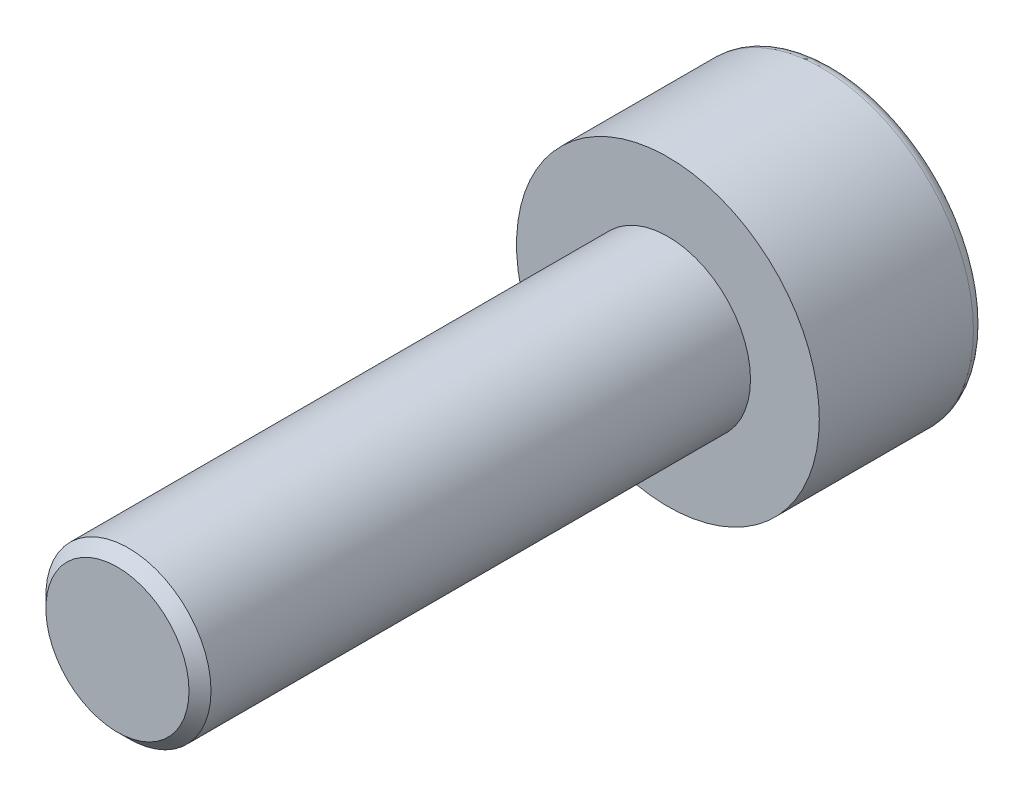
ISO-10303-21;
HEADER;
FILE_DESCRIPTION(('STEP AP214'),'2;1');
FILE_NAME('part.step','',(''),(''),'','','');
FILE_SCHEMA(('AUTOMOTIVE_DESIGN { 1 0 10303 214 1 1 1 1 }'));
ENDSEC;
DATA;
#1=APPLICATION_CONTEXT('core data for automotive mechanical design processes');
#2=APPLICATION_PROTOCOL_DEFINITION('international standard','automotive_design',2000,#1);
#3=PRODUCT_CONTEXT('',#1,'mechanical');
#4=PRODUCT('Part','Part','',(#3));
#5=PRODUCT_RELATED_PRODUCT_CATEGORY('part','',(#4));
#6=PRODUCT_DEFINITION_FORMATION('','',#4);
#7=PRODUCT_DEFINITION_CONTEXT('part definition',#1,'design');
#8=PRODUCT_DEFINITION('design','',#6,#7);
#9=PRODUCT_DEFINITION_SHAPE('','',#8);
#10=(LENGTH_UNIT() NAMED_UNIT(*) SI_UNIT(.MILLI.,.METRE.));
#11=(NAMED_UNIT(*) PLANE_ANGLE_UNIT() SI_UNIT($,.RADIAN.));
#12=(NAMED_UNIT(*) SI_UNIT($,.STERADIAN.) SOLID_ANGLE_UNIT());
#13=UNCERTAINTY_MEASURE_WITH_UNIT(LENGTH_MEASURE(1.E-05),#10,'distance_accuracy_value','');
#14=(GEOMETRIC_REPRESENTATION_CONTEXT(3) GLOBAL_UNCERTAINTY_ASSIGNED_CONTEXT((#13)) GLOBAL_UNIT_ASSIGNED_CONTEXT((#10,
#11,#12)) REPRESENTATION_CONTEXT('',''));
#15=CARTESIAN_POINT('',(0.,0.,0.));
#16=DIRECTION('',(0.,0.,1.));
#17=DIRECTION('',(1.,0.,0.));
#18=AXIS2_PLACEMENT_3D('',#15,#16,#17);
#19=CARTESIAN_POINT('',(0.,0.,3.));
#20=DIRECTION('',(0.,0.,1.));
#21=DIRECTION('',(1.,0.,0.));
#22=AXIS2_PLACEMENT_3D('',#19,#20,#21);
#23=PLANE('',#22);
#24=CARTESIAN_POINT('',(0.,0.,3.));
#25=DIRECTION('',(0.,0.,1.));
#26=DIRECTION('',(1.,0.,0.));
#27=AXIS2_PLACEMENT_3D('',#24,#25,#26);
#28=CIRCLE('',#27,2.75);
#29=CARTESIAN_POINT('',(2.75,0.,3.));
#30=VERTEX_POINT('',#29);
#31=EDGE_CURVE('E144',#30,#30,#28,.T.);
#32=ORIENTED_EDGE('',*,*,#31,.T.);
#33=EDGE_LOOP('',(#32));
#34=FACE_BOUND('',#33,.T.);
#35=CARTESIAN_POINT('',(0.,0.,3.));
#36=DIRECTION('',(0.,0.,1.));
#37=DIRECTION('',(1.,0.,0.));
#38=AXIS2_PLACEMENT_3D('',#35,#36,#37);
#39=CIRCLE('',#38,1.5);
#40=CARTESIAN_POINT('',(1.5,0.,3.));
#41=VERTEX_POINT('',#40);
#42=EDGE_CURVE('E136',#41,#41,#39,.T.);
#43=ORIENTED_EDGE('',*,*,#42,.F.);
#44=EDGE_LOOP('',(#43));
#45=FACE_BOUND('',#44,.T.);
#46=ADVANCED_FACE('F34',(#34,#45),#23,.T.);
#47=CARTESIAN_POINT('',(0.,0.,3.));
#48=DIRECTION('',(0.,0.,-1.));
#49=DIRECTION('',(-1.,0.,0.));
#50=AXIS2_PLACEMENT_3D('',#47,#48,#49);
#51=CYLINDRICAL_SURFACE('',#50,2.75);
#52=CARTESIAN_POINT('',(0.,0.,0.2));
#53=DIRECTION('',(0.,0.,1.));
#54=DIRECTION('',(1.,0.,0.));
#55=AXIS2_PLACEMENT_3D('',#52,#53,#54);
#56=CIRCLE('',#55,2.75);
#57=CARTESIAN_POINT('',(2.75,0.,0.2));
#58=VERTEX_POINT('',#57);
#59=EDGE_CURVE('E42',#58,#58,#56,.T.);
#60=ORIENTED_EDGE('',*,*,#59,.T.);
#61=EDGE_LOOP('',(#60));
#62=FACE_BOUND('',#61,.T.);
#63=ORIENTED_EDGE('',*,*,#31,.F.);
#64=EDGE_LOOP('',(#63));
#65=FACE_BOUND('',#64,.T.);
#66=ADVANCED_FACE('F155',(#62,#65),#51,.T.);
#67=CARTESIAN_POINT('',(0.,0.,0.));
#68=DIRECTION('',(0.,0.,1.));
#69=DIRECTION('',(1.,0.,0.));
#70=AXIS2_PLACEMENT_3D('',#67,#68,#69);
#71=PLANE('',#70);
#72=DIRECTION('',(0.5,0.866025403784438,0.));
#73=VECTOR('',#72,1.);
#74=CARTESIAN_POINT('',(-1.44337567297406,0.,0.));
#75=LINE('',#74,#73);
#76=CARTESIAN_POINT('',(-1.44337567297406,0.,0.));
#77=VERTEX_POINT('',#76);
#78=CARTESIAN_POINT('',(-0.721687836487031,1.25,0.));
#79=VERTEX_POINT('',#78);
#80=EDGE_CURVE('E123',#77,#79,#75,.T.);
#81=ORIENTED_EDGE('',*,*,#80,.F.);
#82=DIRECTION('',(-0.5,0.866025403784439,0.));
#83=VECTOR('',#82,1.);
#84=CARTESIAN_POINT('',(-0.721687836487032,-1.25,0.));
#85=LINE('',#84,#83);
#86=CARTESIAN_POINT('',(-0.721687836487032,-1.25,0.));
#87=VERTEX_POINT('',#86);
#88=EDGE_CURVE('E49',#87,#77,#85,.T.);
#89=ORIENTED_EDGE('',*,*,#88,.F.);
#90=DIRECTION('',(-1.,0.,0.));
#91=VECTOR('',#90,1.);
#92=CARTESIAN_POINT('',(0.721687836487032,-1.25,0.));
#93=LINE('',#92,#91);
#94=CARTESIAN_POINT('',(0.721687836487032,-1.25,0.));
#95=VERTEX_POINT('',#94);
#96=EDGE_CURVE('E132',#95,#87,#93,.T.);
#97=ORIENTED_EDGE('',*,*,#96,.F.);
#98=DIRECTION('',(-0.5,-0.866025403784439,0.));
#99=VECTOR('',#98,1.);
#100=CARTESIAN_POINT('',(1.44337567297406,0.,0.));
#101=LINE('',#100,#99);
#102=CARTESIAN_POINT('',(1.44337567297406,0.,0.));
#103=VERTEX_POINT('',#102);
#104=EDGE_CURVE('E130',#103,#95,#101,.T.);
#105=ORIENTED_EDGE('',*,*,#104,.F.);
#106=DIRECTION('',(0.5,-0.866025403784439,0.));
#107=VECTOR('',#106,1.);
#108=CARTESIAN_POINT('',(0.721687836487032,1.25,0.));
#109=LINE('',#108,#107);
#110=CARTESIAN_POINT('',(0.721687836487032,1.25,0.));
#111=VERTEX_POINT('',#110);
#112=EDGE_CURVE('E97',#111,#103,#109,.T.);
#113=ORIENTED_EDGE('',*,*,#112,.F.);
#114=DIRECTION('',(1.,0.,0.));
#115=VECTOR('',#114,1.);
#116=CARTESIAN_POINT('',(-0.721687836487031,1.25,0.));
#117=LINE('',#116,#115);
#118=EDGE_CURVE('E126',#79,#111,#117,.T.);
#119=ORIENTED_EDGE('',*,*,#118,.F.);
#120=EDGE_LOOP('',(#81,#89,#97,#105,#113,#119));
#121=FACE_BOUND('',#120,.T.);
#122=CARTESIAN_POINT('',(0.,0.,0.));
#123=DIRECTION('',(0.,0.,1.));
#124=DIRECTION('',(1.,0.,0.));
#125=AXIS2_PLACEMENT_3D('',#122,#123,#124);
#126=CIRCLE('',#125,2.55);
#127=CARTESIAN_POINT('',(2.55,0.,0.));
#128=VERTEX_POINT('',#127);
#129=EDGE_CURVE('E11',#128,#128,#126,.F.);
#130=ORIENTED_EDGE('',*,*,#129,.T.);
#131=EDGE_LOOP('',(#130));
#132=FACE_BOUND('',#131,.T.);
#133=ADVANCED_FACE('F177',(#121,#132),#71,.F.);
#134=CARTESIAN_POINT('',(0.,0.,13.));
#135=DIRECTION('',(0.,0.,-1.));
#136=DIRECTION('',(-1.,0.,0.));
#137=AXIS2_PLACEMENT_3D('',#134,#135,#136);
#138=CYLINDRICAL_SURFACE('',#137,1.5);
#139=CARTESIAN_POINT('',(0.,0.,12.8));
#140=DIRECTION('',(0.,0.,1.));
#141=DIRECTION('',(1.,0.,0.));
#142=AXIS2_PLACEMENT_3D('',#139,#140,#141);
#143=CIRCLE('',#142,1.5);
#144=CARTESIAN_POINT('',(1.5,0.,12.8));
#145=VERTEX_POINT('',#144);
#146=EDGE_CURVE('E150',#145,#145,#143,.F.);
#147=ORIENTED_EDGE('',*,*,#146,.T.);
#148=EDGE_LOOP('',(#147));
#149=FACE_BOUND('',#148,.T.);
#150=ORIENTED_EDGE('',*,*,#42,.T.);
#151=EDGE_LOOP('',(#150));
#152=FACE_BOUND('',#151,.T.);
#153=ADVANCED_FACE('F182',(#149,#152),#138,.T.);
#154=CARTESIAN_POINT('',(0.,0.,13.));
#155=DIRECTION('',(0.,0.,1.));
#156=DIRECTION('',(1.,0.,0.));
#157=AXIS2_PLACEMENT_3D('',#154,#155,#156);
#158=PLANE('',#157);
#159=CARTESIAN_POINT('',(0.,0.,13.));
#160=DIRECTION('',(0.,0.,1.));
#161=DIRECTION('',(1.,0.,0.));
#162=AXIS2_PLACEMENT_3D('',#159,#160,#161);
#163=CIRCLE('',#162,1.3);
#164=CARTESIAN_POINT('',(1.3,0.,13.));
#165=VERTEX_POINT('',#164);
#166=EDGE_CURVE('E147',#165,#165,#163,.T.);
#167=ORIENTED_EDGE('',*,*,#166,.T.);
#168=EDGE_LOOP('',(#167));
#169=FACE_BOUND('',#168,.T.);
#170=ADVANCED_FACE('F168',(#169),#158,.T.);
#171=CARTESIAN_POINT('',(0.,0.,13.));
#172=DIRECTION('',(0.,0.,-1.));
#173=DIRECTION('',(-1.,0.,0.));
#174=AXIS2_PLACEMENT_3D('',#171,#172,#173);
#175=CONICAL_SURFACE('',#174,1.3,0.785398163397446);
#176=ORIENTED_EDGE('',*,*,#146,.F.);
#177=EDGE_LOOP('',(#176));
#178=FACE_BOUND('',#177,.T.);
#179=ORIENTED_EDGE('',*,*,#166,.F.);
#180=EDGE_LOOP('',(#179));
#181=FACE_BOUND('',#180,.T.);
#182=ADVANCED_FACE('F160',(#178,#181),#175,.T.);
#183=CARTESIAN_POINT('',(0.,0.,0.2));
#184=DIRECTION('',(0.,0.,1.));
#185=DIRECTION('',(1.,0.,0.));
#186=AXIS2_PLACEMENT_3D('',#183,#184,#185);
#187=TOROIDAL_SURFACE('',#186,2.55,0.2);
#188=ORIENTED_EDGE('',*,*,#129,.F.);
#189=EDGE_LOOP('',(#188));
#190=FACE_BOUND('',#189,.T.);
#191=ORIENTED_EDGE('',*,*,#59,.F.);
#192=EDGE_LOOP('',(#191));
#193=FACE_BOUND('',#192,.T.);
#194=ADVANCED_FACE('F36',(#190,#193),#187,.T.);
#195=CARTESIAN_POINT('',(-0.721687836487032,-1.25,2.5));
#196=DIRECTION('',(-0.866025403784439,-0.5,0.));
#197=DIRECTION('',(0.5,-0.866025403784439,0.));
#198=AXIS2_PLACEMENT_3D('',#195,#196,#197);
#199=PLANE('',#198);
#200=ORIENTED_EDGE('',*,*,#88,.T.);
#201=DIRECTION('',(0.,0.,-1.));
#202=VECTOR('',#201,1.);
#203=CARTESIAN_POINT('',(-1.44337567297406,0.,2.5));
#204=LINE('',#203,#202);
#205=CARTESIAN_POINT('',(-1.44337567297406,0.,2.5));
#206=VERTEX_POINT('',#205);
#207=EDGE_CURVE('E79',#206,#77,#204,.T.);
#208=ORIENTED_EDGE('',*,*,#207,.F.);
#209=DIRECTION('',(-0.5,0.866025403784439,0.));
#210=VECTOR('',#209,1.);
#211=CARTESIAN_POINT('',(-0.721687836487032,-1.25,2.5));
#212=LINE('',#211,#210);
#213=CARTESIAN_POINT('',(-0.721687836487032,-1.25,2.5));
#214=VERTEX_POINT('',#213);
#215=EDGE_CURVE('E134',#214,#206,#212,.T.);
#216=ORIENTED_EDGE('',*,*,#215,.F.);
#217=DIRECTION('',(0.,0.,-1.));
#218=VECTOR('',#217,1.);
#219=CARTESIAN_POINT('',(-0.721687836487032,-1.25,2.5));
#220=LINE('',#219,#218);
#221=EDGE_CURVE('E57',#214,#87,#220,.T.);
#222=ORIENTED_EDGE('',*,*,#221,.T.);
#223=EDGE_LOOP('',(#200,#208,#216,#222));
#224=FACE_BOUND('',#223,.T.);
#225=ADVANCED_FACE('F159',(#224),#199,.F.);
#226=CARTESIAN_POINT('',(0.721687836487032,-1.25,2.5));
#227=DIRECTION('',(0.,-1.,0.));
#228=DIRECTION('',(1.,0.,0.));
#229=AXIS2_PLACEMENT_3D('',#226,#227,#228);
#230=PLANE('',#229);
#231=ORIENTED_EDGE('',*,*,#96,.T.);
#232=ORIENTED_EDGE('',*,*,#221,.F.);
#233=DIRECTION('',(-1.,0.,0.));
#234=VECTOR('',#233,1.);
#235=CARTESIAN_POINT('',(0.721687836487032,-1.25,2.5));
#236=LINE('',#235,#234);
#237=CARTESIAN_POINT('',(0.721687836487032,-1.25,2.5));
#238=VERTEX_POINT('',#237);
#239=EDGE_CURVE('E109',#238,#214,#236,.T.);
#240=ORIENTED_EDGE('',*,*,#239,.F.);
#241=DIRECTION('',(0.,0.,-1.));
#242=VECTOR('',#241,1.);
#243=CARTESIAN_POINT('',(0.721687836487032,-1.25,2.5));
#244=LINE('',#243,#242);
#245=EDGE_CURVE('E101',#238,#95,#244,.T.);
#246=ORIENTED_EDGE('',*,*,#245,.T.);
#247=EDGE_LOOP('',(#231,#232,#240,#246));
#248=FACE_BOUND('',#247,.T.);
#249=ADVANCED_FACE('F166',(#248),#230,.F.);
#250=CARTESIAN_POINT('',(1.44337567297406,0.,2.5));
#251=DIRECTION('',(0.866025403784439,-0.5,0.));
#252=DIRECTION('',(0.5,0.866025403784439,0.));
#253=AXIS2_PLACEMENT_3D('',#250,#251,#252);
#254=PLANE('',#253);
#255=ORIENTED_EDGE('',*,*,#104,.T.);
#256=ORIENTED_EDGE('',*,*,#245,.F.);
#257=DIRECTION('',(-0.5,-0.866025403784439,0.));
#258=VECTOR('',#257,1.);
#259=CARTESIAN_POINT('',(1.44337567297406,0.,2.5));
#260=LINE('',#259,#258);
#261=CARTESIAN_POINT('',(1.44337567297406,0.,2.5));
#262=VERTEX_POINT('',#261);
#263=EDGE_CURVE('E105',#262,#238,#260,.T.);
#264=ORIENTED_EDGE('',*,*,#263,.F.);
#265=DIRECTION('',(0.,0.,-1.));
#266=VECTOR('',#265,1.);
#267=CARTESIAN_POINT('',(1.44337567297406,0.,2.5));
#268=LINE('',#267,#266);
#269=EDGE_CURVE('E90',#262,#103,#268,.T.);
#270=ORIENTED_EDGE('',*,*,#269,.T.);
#271=EDGE_LOOP('',(#255,#256,#264,#270));
#272=FACE_BOUND('',#271,.T.);
#273=ADVANCED_FACE('F106',(#272),#254,.F.);
#274=CARTESIAN_POINT('',(0.721687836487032,1.25,2.5));
#275=DIRECTION('',(0.866025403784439,0.5,0.));
#276=DIRECTION('',(-0.5,0.866025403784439,0.));
#277=AXIS2_PLACEMENT_3D('',#274,#275,#276);
#278=PLANE('',#277);
#279=ORIENTED_EDGE('',*,*,#112,.T.);
#280=ORIENTED_EDGE('',*,*,#269,.F.);
#281=DIRECTION('',(0.5,-0.866025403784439,0.));
#282=VECTOR('',#281,1.);
#283=CARTESIAN_POINT('',(0.721687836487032,1.25,2.5));
#284=LINE('',#283,#282);
#285=CARTESIAN_POINT('',(0.721687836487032,1.25,2.5));
#286=VERTEX_POINT('',#285);
#287=EDGE_CURVE('E94',#286,#262,#284,.T.);
#288=ORIENTED_EDGE('',*,*,#287,.F.);
#289=DIRECTION('',(0.,0.,-1.));
#290=VECTOR('',#289,1.);
#291=CARTESIAN_POINT('',(0.721687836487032,1.25,2.5));
#292=LINE('',#291,#290);
#293=EDGE_CURVE('E102',#286,#111,#292,.T.);
#294=ORIENTED_EDGE('',*,*,#293,.T.);
#295=EDGE_LOOP('',(#279,#280,#288,#294));
#296=FACE_BOUND('',#295,.T.);
#297=ADVANCED_FACE('F92',(#296),#278,.F.);
#298=CARTESIAN_POINT('',(-0.721687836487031,1.25,2.5));
#299=DIRECTION('',(0.,1.,0.));
#300=DIRECTION('',(0.,0.,1.));
#301=AXIS2_PLACEMENT_3D('',#298,#299,#300);
#302=PLANE('',#301);
#303=ORIENTED_EDGE('',*,*,#118,.T.);
#304=ORIENTED_EDGE('',*,*,#293,.F.);
#305=DIRECTION('',(1.,0.,0.));
#306=VECTOR('',#305,1.);
#307=CARTESIAN_POINT('',(-0.721687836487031,1.25,2.5));
#308=LINE('',#307,#306);
#309=CARTESIAN_POINT('',(-0.721687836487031,1.25,2.5));
#310=VERTEX_POINT('',#309);
#311=EDGE_CURVE('E115',#310,#286,#308,.T.);
#312=ORIENTED_EDGE('',*,*,#311,.F.);
#313=DIRECTION('',(0.,0.,-1.));
#314=VECTOR('',#313,1.);
#315=CARTESIAN_POINT('',(-0.721687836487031,1.25,2.5));
#316=LINE('',#315,#314);
#317=EDGE_CURVE('E139',#310,#79,#316,.T.);
#318=ORIENTED_EDGE('',*,*,#317,.T.);
#319=EDGE_LOOP('',(#303,#304,#312,#318));
#320=FACE_BOUND('',#319,.T.);
#321=ADVANCED_FACE('F207',(#320),#302,.F.);
#322=CARTESIAN_POINT('',(-1.44337567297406,0.,2.5));
#323=DIRECTION('',(-0.866025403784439,0.5,0.));
#324=DIRECTION('',(-0.5,-0.866025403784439,0.));
#325=AXIS2_PLACEMENT_3D('',#322,#323,#324);
#326=PLANE('',#325);
#327=ORIENTED_EDGE('',*,*,#80,.T.);
#328=ORIENTED_EDGE('',*,*,#317,.F.);
#329=DIRECTION('',(0.5,0.866025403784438,0.));
#330=VECTOR('',#329,1.);
#331=CARTESIAN_POINT('',(-1.44337567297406,0.,2.5));
#332=LINE('',#331,#330);
#333=EDGE_CURVE('E117',#206,#310,#332,.T.);
#334=ORIENTED_EDGE('',*,*,#333,.F.);
#335=ORIENTED_EDGE('',*,*,#207,.T.);
#336=EDGE_LOOP('',(#327,#328,#334,#335));
#337=FACE_BOUND('',#336,.T.);
#338=ADVANCED_FACE('F195',(#337),#326,.F.);
#339=CARTESIAN_POINT('',(-1.44337567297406,0.,2.5));
#340=DIRECTION('',(0.,0.,-1.));
#341=DIRECTION('',(-1.,0.,0.));
#342=AXIS2_PLACEMENT_3D('',#339,#340,#341);
#343=PLANE('',#342);
#344=ORIENTED_EDGE('',*,*,#215,.T.);
#345=ORIENTED_EDGE('',*,*,#333,.T.);
#346=ORIENTED_EDGE('',*,*,#311,.T.);
#347=ORIENTED_EDGE('',*,*,#287,.T.);
#348=ORIENTED_EDGE('',*,*,#263,.T.);
#349=ORIENTED_EDGE('',*,*,#239,.T.);
#350=EDGE_LOOP('',(#344,#345,#346,#347,#348,#349));
#351=FACE_BOUND('',#350,.T.);
#352=ADVANCED_FACE('F112',(#351),#343,.T.);
#353=CLOSED_SHELL('',(#46,#66,#133,#153,#170,#182,#194,#225,#249,#273,#297,#321,#338,#352));
#354=MANIFOLD_SOLID_BREP('B2',#353);
#355=ADVANCED_BREP_SHAPE_REPRESENTATION('',(#18,#354),#14);
#356=SHAPE_DEFINITION_REPRESENTATION(#9,#355);
ENDSEC;
END-ISO-10303-21;
